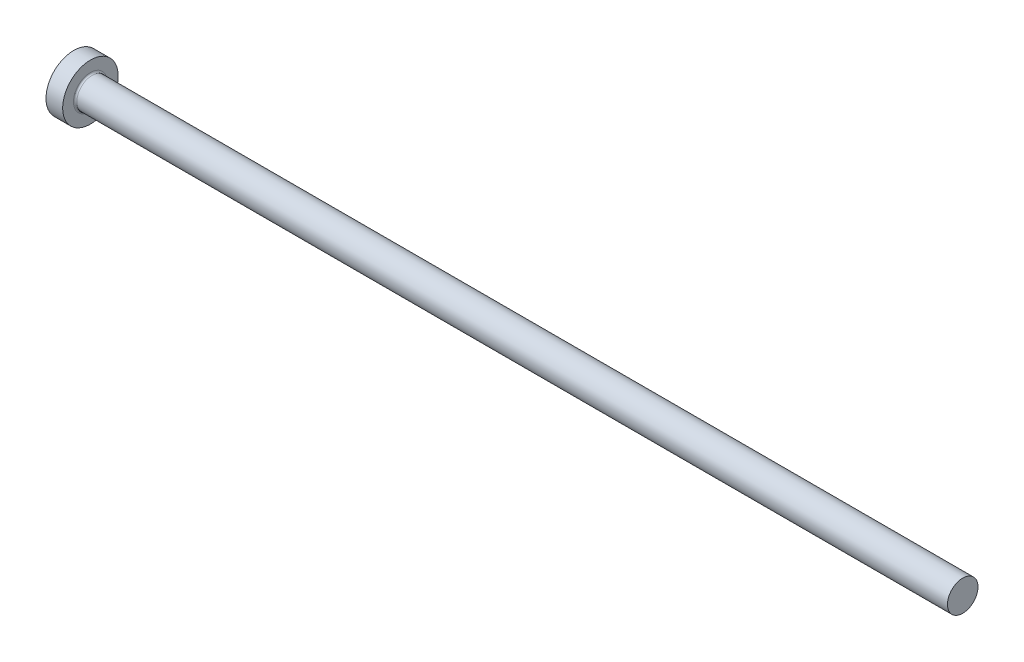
ISO-10303-21;
HEADER;
FILE_DESCRIPTION(('STEP AP214'),'2;1');
FILE_NAME('part.step','',(''),(''),'','','');
FILE_SCHEMA(('AUTOMOTIVE_DESIGN { 1 0 10303 214 1 1 1 1 }'));
ENDSEC;
DATA;
#1=APPLICATION_CONTEXT('core data for automotive mechanical design processes');
#2=APPLICATION_PROTOCOL_DEFINITION('international standard','automotive_design',2000,#1);
#3=PRODUCT_CONTEXT('',#1,'mechanical');
#4=PRODUCT('Part','Part','',(#3));
#5=PRODUCT_RELATED_PRODUCT_CATEGORY('part','',(#4));
#6=PRODUCT_DEFINITION_FORMATION('','',#4);
#7=PRODUCT_DEFINITION_CONTEXT('part definition',#1,'design');
#8=PRODUCT_DEFINITION('design','',#6,#7);
#9=PRODUCT_DEFINITION_SHAPE('','',#8);
#10=(LENGTH_UNIT() NAMED_UNIT(*) SI_UNIT(.MILLI.,.METRE.));
#11=(NAMED_UNIT(*) PLANE_ANGLE_UNIT() SI_UNIT($,.RADIAN.));
#12=(NAMED_UNIT(*) SI_UNIT($,.STERADIAN.) SOLID_ANGLE_UNIT());
#13=UNCERTAINTY_MEASURE_WITH_UNIT(LENGTH_MEASURE(1.E-05),#10,'distance_accuracy_value','');
#14=(GEOMETRIC_REPRESENTATION_CONTEXT(3) GLOBAL_UNCERTAINTY_ASSIGNED_CONTEXT((#13)) GLOBAL_UNIT_ASSIGNED_CONTEXT((#10,
#11,#12)) REPRESENTATION_CONTEXT('',''));
#15=CARTESIAN_POINT('',(0.,0.,0.));
#16=DIRECTION('',(0.,0.,1.));
#17=DIRECTION('',(1.,0.,0.));
#18=AXIS2_PLACEMENT_3D('',#15,#16,#17);
#19=CARTESIAN_POINT('',(0.,0.,0.));
#20=DIRECTION('',(-1.,0.,0.));
#21=DIRECTION('',(0.,-1.,0.));
#22=AXIS2_PLACEMENT_3D('',#19,#20,#21);
#23=PLANE('',#22);
#24=CARTESIAN_POINT('',(0.,0.,0.));
#25=DIRECTION('',(1.,0.,0.));
#26=DIRECTION('',(0.,1.,0.));
#27=AXIS2_PLACEMENT_3D('',#24,#25,#26);
#28=CIRCLE('',#27,5.);
#29=CARTESIAN_POINT('',(0.,5.,0.));
#30=VERTEX_POINT('',#29);
#31=EDGE_CURVE('E24',#30,#30,#28,.T.);
#32=ORIENTED_EDGE('',*,*,#31,.F.);
#33=EDGE_LOOP('',(#32));
#34=FACE_BOUND('',#33,.T.);
#35=ADVANCED_FACE('F13',(#34),#23,.T.);
#36=CARTESIAN_POINT('',(160.,0.,0.));
#37=DIRECTION('',(1.,0.,0.));
#38=DIRECTION('',(0.,1.,0.));
#39=AXIS2_PLACEMENT_3D('',#36,#37,#38);
#40=CYLINDRICAL_SURFACE('',#39,5.);
#41=ORIENTED_EDGE('',*,*,#31,.T.);
#42=EDGE_LOOP('',(#41));
#43=FACE_BOUND('',#42,.T.);
#44=CARTESIAN_POINT('',(3.,0.,0.));
#45=DIRECTION('',(1.,0.,0.));
#46=DIRECTION('',(0.,1.,0.));
#47=AXIS2_PLACEMENT_3D('',#44,#45,#46);
#48=CIRCLE('',#47,5.);
#49=CARTESIAN_POINT('',(3.,5.,0.));
#50=VERTEX_POINT('',#49);
#51=EDGE_CURVE('E28',#50,#50,#48,.T.);
#52=ORIENTED_EDGE('',*,*,#51,.F.);
#53=EDGE_LOOP('',(#52));
#54=FACE_BOUND('',#53,.T.);
#55=ADVANCED_FACE('F50',(#43,#54),#40,.T.);
#56=CARTESIAN_POINT('',(3.,5.,0.));
#57=DIRECTION('',(1.,0.,0.));
#58=DIRECTION('',(0.,1.,0.));
#59=AXIS2_PLACEMENT_3D('',#56,#57,#58);
#60=PLANE('',#59);
#61=CARTESIAN_POINT('',(3.,0.,0.));
#62=DIRECTION('',(1.,0.,0.));
#63=DIRECTION('',(0.,1.,0.));
#64=AXIS2_PLACEMENT_3D('',#61,#62,#63);
#65=CIRCLE('',#64,3.04999999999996);
#66=CARTESIAN_POINT('',(3.,3.04999999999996,0.));
#67=VERTEX_POINT('',#66);
#68=EDGE_CURVE('E8',#67,#67,#65,.F.);
#69=ORIENTED_EDGE('',*,*,#68,.T.);
#70=EDGE_LOOP('',(#69));
#71=FACE_BOUND('',#70,.T.);
#72=ORIENTED_EDGE('',*,*,#51,.T.);
#73=EDGE_LOOP('',(#72));
#74=FACE_BOUND('',#73,.T.);
#75=ADVANCED_FACE('F41',(#71,#74),#60,.T.);
#76=CARTESIAN_POINT('',(160.,0.,0.));
#77=DIRECTION('',(1.,0.,0.));
#78=DIRECTION('',(0.,1.,0.));
#79=AXIS2_PLACEMENT_3D('',#76,#77,#78);
#80=CYLINDRICAL_SURFACE('',#79,2.74999999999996);
#81=CARTESIAN_POINT('',(3.3,0.,0.));
#82=DIRECTION('',(1.,0.,0.));
#83=DIRECTION('',(0.,1.,0.));
#84=AXIS2_PLACEMENT_3D('',#81,#82,#83);
#85=CIRCLE('',#84,2.74999999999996);
#86=CARTESIAN_POINT('',(3.3,2.74999999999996,0.));
#87=VERTEX_POINT('',#86);
#88=EDGE_CURVE('E20',#87,#87,#85,.T.);
#89=ORIENTED_EDGE('',*,*,#88,.T.);
#90=EDGE_LOOP('',(#89));
#91=FACE_BOUND('',#90,.T.);
#92=CARTESIAN_POINT('',(160.,0.,0.));
#93=DIRECTION('',(1.,0.,0.));
#94=DIRECTION('',(0.,1.,0.));
#95=AXIS2_PLACEMENT_3D('',#92,#93,#94);
#96=CIRCLE('',#95,2.75);
#97=CARTESIAN_POINT('',(160.,2.75,0.));
#98=VERTEX_POINT('',#97);
#99=EDGE_CURVE('E33',#98,#98,#96,.T.);
#100=ORIENTED_EDGE('',*,*,#99,.F.);
#101=EDGE_LOOP('',(#100));
#102=FACE_BOUND('',#101,.T.);
#103=ADVANCED_FACE('F39',(#91,#102),#80,.T.);
#104=CARTESIAN_POINT('',(160.,2.75,0.));
#105=DIRECTION('',(1.,0.,0.));
#106=DIRECTION('',(0.,1.,0.));
#107=AXIS2_PLACEMENT_3D('',#104,#105,#106);
#108=PLANE('',#107);
#109=ORIENTED_EDGE('',*,*,#99,.T.);
#110=EDGE_LOOP('',(#109));
#111=FACE_BOUND('',#110,.T.);
#112=ADVANCED_FACE('F37',(#111),#108,.T.);
#113=CARTESIAN_POINT('',(3.3,0.,0.));
#114=DIRECTION('',(1.,0.,0.));
#115=DIRECTION('',(0.,1.,0.));
#116=AXIS2_PLACEMENT_3D('',#113,#114,#115);
#117=TOROIDAL_SURFACE('',#116,3.04999999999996,0.3);
#118=ORIENTED_EDGE('',*,*,#68,.F.);
#119=EDGE_LOOP('',(#118));
#120=FACE_BOUND('',#119,.T.);
#121=ORIENTED_EDGE('',*,*,#88,.F.);
#122=EDGE_LOOP('',(#121));
#123=FACE_BOUND('',#122,.T.);
#124=ADVANCED_FACE('F15',(#120,#123),#117,.F.);
#125=CLOSED_SHELL('',(#35,#55,#75,#103,#112,#124));
#126=MANIFOLD_SOLID_BREP('B1',#125);
#127=ADVANCED_BREP_SHAPE_REPRESENTATION('',(#18,#126),#14);
#128=SHAPE_DEFINITION_REPRESENTATION(#9,#127);
ENDSEC;
END-ISO-10303-21;
